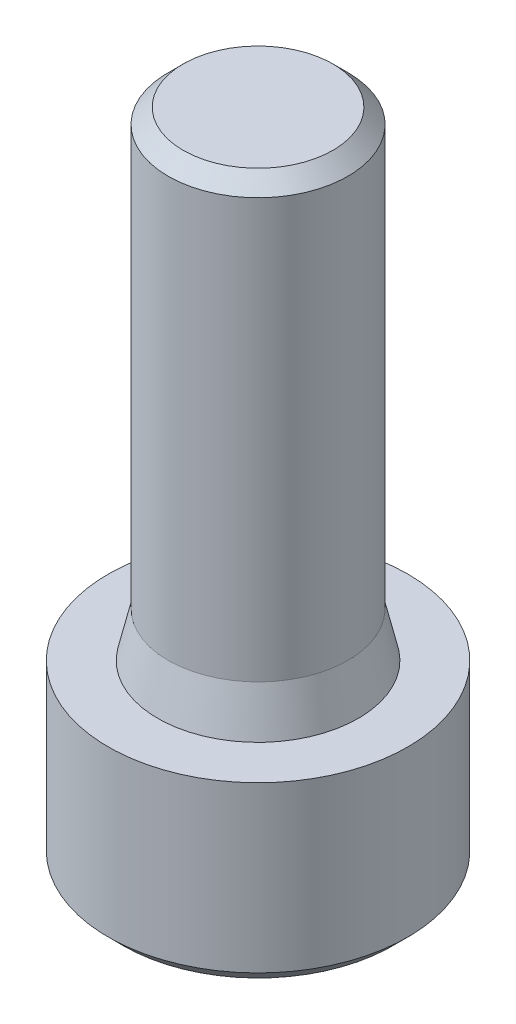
ISO-10303-21;
HEADER;
FILE_DESCRIPTION(('STEP AP214'),'2;1');
FILE_NAME('part.step','',(''),(''),'','','');
FILE_SCHEMA(('AUTOMOTIVE_DESIGN { 1 0 10303 214 1 1 1 1 }'));
ENDSEC;
DATA;
#1=APPLICATION_CONTEXT('core data for automotive mechanical design processes');
#2=APPLICATION_PROTOCOL_DEFINITION('international standard','automotive_design',2000,#1);
#3=PRODUCT_CONTEXT('',#1,'mechanical');
#4=PRODUCT('Part','Part','',(#3));
#5=PRODUCT_RELATED_PRODUCT_CATEGORY('part','',(#4));
#6=PRODUCT_DEFINITION_FORMATION('','',#4);
#7=PRODUCT_DEFINITION_CONTEXT('part definition',#1,'design');
#8=PRODUCT_DEFINITION('design','',#6,#7);
#9=PRODUCT_DEFINITION_SHAPE('','',#8);
#10=(LENGTH_UNIT() NAMED_UNIT(*) SI_UNIT(.MILLI.,.METRE.));
#11=(NAMED_UNIT(*) PLANE_ANGLE_UNIT() SI_UNIT($,.RADIAN.));
#12=(NAMED_UNIT(*) SI_UNIT($,.STERADIAN.) SOLID_ANGLE_UNIT());
#13=UNCERTAINTY_MEASURE_WITH_UNIT(LENGTH_MEASURE(1.E-05),#10,'distance_accuracy_value','');
#14=(GEOMETRIC_REPRESENTATION_CONTEXT(3) GLOBAL_UNCERTAINTY_ASSIGNED_CONTEXT((#13)) GLOBAL_UNIT_ASSIGNED_CONTEXT((#10,
#11,#12)) REPRESENTATION_CONTEXT('',''));
#15=CARTESIAN_POINT('',(0.,0.,0.));
#16=DIRECTION('',(0.,0.,1.));
#17=DIRECTION('',(1.,0.,0.));
#18=AXIS2_PLACEMENT_3D('',#15,#16,#17);
#19=CARTESIAN_POINT('',(0.,22.,0.));
#20=DIRECTION('',(0.,1.,0.));
#21=DIRECTION('',(0.,0.,1.));
#22=AXIS2_PLACEMENT_3D('',#19,#20,#21);
#23=PLANE('',#22);
#24=CARTESIAN_POINT('',(0.,22.,0.));
#25=DIRECTION('',(0.,1.,0.));
#26=DIRECTION('',(0.,0.,1.));
#27=AXIS2_PLACEMENT_3D('',#24,#25,#26);
#28=CIRCLE('',#27,2.49999999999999);
#29=CARTESIAN_POINT('',(0.,22.,2.49999999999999));
#30=VERTEX_POINT('',#29);
#31=EDGE_CURVE('E64',#30,#30,#28,.T.);
#32=ORIENTED_EDGE('',*,*,#31,.T.);
#33=EDGE_LOOP('',(#32));
#34=FACE_BOUND('',#33,.T.);
#35=ADVANCED_FACE('F49',(#34),#23,.T.);
#36=CARTESIAN_POINT('',(0.,0.,0.));
#37=DIRECTION('',(0.,-1.,0.));
#38=DIRECTION('',(0.,0.,-1.));
#39=AXIS2_PLACEMENT_3D('',#36,#37,#38);
#40=CYLINDRICAL_SURFACE('',#39,3.);
#41=CARTESIAN_POINT('',(0.,21.5,0.));
#42=DIRECTION('',(0.,1.,0.));
#43=DIRECTION('',(0.,0.,1.));
#44=AXIS2_PLACEMENT_3D('',#41,#42,#43);
#45=CIRCLE('',#44,3.);
#46=CARTESIAN_POINT('',(0.,21.5,3.));
#47=VERTEX_POINT('',#46);
#48=EDGE_CURVE('E149',#47,#47,#45,.F.);
#49=ORIENTED_EDGE('',*,*,#48,.T.);
#50=EDGE_LOOP('',(#49));
#51=FACE_BOUND('',#50,.T.);
#52=CARTESIAN_POINT('',(0.,7.5,0.));
#53=DIRECTION('',(0.,-1.,0.));
#54=DIRECTION('',(0.,0.,-1.));
#55=AXIS2_PLACEMENT_3D('',#52,#53,#54);
#56=CIRCLE('',#55,3.);
#57=CARTESIAN_POINT('',(0.,7.5,-3.));
#58=VERTEX_POINT('',#57);
#59=EDGE_CURVE('E140',#58,#58,#56,.T.);
#60=ORIENTED_EDGE('',*,*,#59,.F.);
#61=EDGE_LOOP('',(#60));
#62=FACE_BOUND('',#61,.T.);
#63=ADVANCED_FACE('F160',(#51,#62),#40,.T.);
#64=CARTESIAN_POINT('',(0.,6.,0.));
#65=DIRECTION('',(0.,-1.,0.));
#66=DIRECTION('',(0.,0.,-1.));
#67=AXIS2_PLACEMENT_3D('',#64,#65,#66);
#68=CONICAL_SURFACE('',#67,3.35,0.229231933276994);
#69=ORIENTED_EDGE('',*,*,#59,.T.);
#70=EDGE_LOOP('',(#69));
#71=FACE_BOUND('',#70,.T.);
#72=CARTESIAN_POINT('',(0.,6.,0.));
#73=DIRECTION('',(0.,-1.,0.));
#74=DIRECTION('',(0.,0.,-1.));
#75=AXIS2_PLACEMENT_3D('',#72,#73,#74);
#76=CIRCLE('',#75,3.35);
#77=CARTESIAN_POINT('',(0.,6.,-3.35));
#78=VERTEX_POINT('',#77);
#79=EDGE_CURVE('E137',#78,#78,#76,.T.);
#80=ORIENTED_EDGE('',*,*,#79,.F.);
#81=EDGE_LOOP('',(#80));
#82=FACE_BOUND('',#81,.T.);
#83=ADVANCED_FACE('F163',(#71,#82),#68,.T.);
#84=CARTESIAN_POINT('',(0.,6.,-3.35));
#85=DIRECTION('',(0.,1.,0.));
#86=DIRECTION('',(0.,0.,1.));
#87=AXIS2_PLACEMENT_3D('',#84,#85,#86);
#88=PLANE('',#87);
#89=ORIENTED_EDGE('',*,*,#79,.T.);
#90=EDGE_LOOP('',(#89));
#91=FACE_BOUND('',#90,.T.);
#92=CARTESIAN_POINT('',(0.,6.,0.));
#93=DIRECTION('',(0.,-1.,0.));
#94=DIRECTION('',(0.,0.,-1.));
#95=AXIS2_PLACEMENT_3D('',#92,#93,#94);
#96=CIRCLE('',#95,5.);
#97=CARTESIAN_POINT('',(0.,6.,-5.));
#98=VERTEX_POINT('',#97);
#99=EDGE_CURVE('E134',#98,#98,#96,.T.);
#100=ORIENTED_EDGE('',*,*,#99,.F.);
#101=EDGE_LOOP('',(#100));
#102=FACE_BOUND('',#101,.T.);
#103=ADVANCED_FACE('F169',(#91,#102),#88,.T.);
#104=CARTESIAN_POINT('',(0.,0.,0.));
#105=DIRECTION('',(0.,-1.,0.));
#106=DIRECTION('',(0.,0.,-1.));
#107=AXIS2_PLACEMENT_3D('',#104,#105,#106);
#108=CYLINDRICAL_SURFACE('',#107,5.);
#109=CARTESIAN_POINT('',(0.,0.5,0.));
#110=DIRECTION('',(0.,-1.,0.));
#111=DIRECTION('',(0.,0.,-1.));
#112=AXIS2_PLACEMENT_3D('',#109,#110,#111);
#113=CIRCLE('',#112,5.);
#114=CARTESIAN_POINT('',(0.,0.5,-5.));
#115=VERTEX_POINT('',#114);
#116=EDGE_CURVE('E146',#115,#115,#113,.F.);
#117=ORIENTED_EDGE('',*,*,#116,.T.);
#118=EDGE_LOOP('',(#117));
#119=FACE_BOUND('',#118,.T.);
#120=ORIENTED_EDGE('',*,*,#99,.T.);
#121=EDGE_LOOP('',(#120));
#122=FACE_BOUND('',#121,.T.);
#123=ADVANCED_FACE('F175',(#119,#122),#108,.T.);
#124=CARTESIAN_POINT('',(0.,0.,0.));
#125=DIRECTION('',(0.,-1.,0.));
#126=DIRECTION('',(0.,0.,-1.));
#127=AXIS2_PLACEMENT_3D('',#124,#125,#126);
#128=PLANE('',#127);
#129=CARTESIAN_POINT('',(0.,0.,0.));
#130=DIRECTION('',(0.,1.,0.));
#131=DIRECTION('',(0.,0.,1.));
#132=AXIS2_PLACEMENT_3D('',#129,#130,#131);
#133=CIRCLE('',#132,3.);
#134=CARTESIAN_POINT('',(0.,0.,3.));
#135=VERTEX_POINT('',#134);
#136=EDGE_CURVE('E375',#135,#135,#133,.T.);
#137=ORIENTED_EDGE('',*,*,#136,.T.);
#138=EDGE_LOOP('',(#137));
#139=FACE_BOUND('',#138,.T.);
#140=CARTESIAN_POINT('',(0.,0.,0.));
#141=DIRECTION('',(0.,-1.,0.));
#142=DIRECTION('',(0.,0.,-1.));
#143=AXIS2_PLACEMENT_3D('',#140,#141,#142);
#144=CIRCLE('',#143,4.5);
#145=CARTESIAN_POINT('',(0.,0.,-4.5));
#146=VERTEX_POINT('',#145);
#147=EDGE_CURVE('E143',#146,#146,#144,.T.);
#148=ORIENTED_EDGE('',*,*,#147,.T.);
#149=EDGE_LOOP('',(#148));
#150=FACE_BOUND('',#149,.T.);
#151=ADVANCED_FACE('F180',(#139,#150),#128,.T.);
#152=CARTESIAN_POINT('',(0.,0.,0.));
#153=DIRECTION('',(0.,1.,0.));
#154=DIRECTION('',(0.,0.,1.));
#155=AXIS2_PLACEMENT_3D('',#152,#153,#154);
#156=CONICAL_SURFACE('',#155,4.5,0.785398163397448);
#157=ORIENTED_EDGE('',*,*,#116,.F.);
#158=EDGE_LOOP('',(#157));
#159=FACE_BOUND('',#158,.T.);
#160=ORIENTED_EDGE('',*,*,#147,.F.);
#161=EDGE_LOOP('',(#160));
#162=FACE_BOUND('',#161,.T.);
#163=ADVANCED_FACE('F157',(#159,#162),#156,.T.);
#164=CARTESIAN_POINT('',(0.,21.5,0.));
#165=DIRECTION('',(0.,-1.,0.));
#166=DIRECTION('',(0.,0.,-1.));
#167=AXIS2_PLACEMENT_3D('',#164,#165,#166);
#168=CONICAL_SURFACE('',#167,3.,0.785398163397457);
#169=ORIENTED_EDGE('',*,*,#31,.F.);
#170=EDGE_LOOP('',(#169));
#171=FACE_BOUND('',#170,.T.);
#172=ORIENTED_EDGE('',*,*,#48,.F.);
#173=EDGE_LOOP('',(#172));
#174=FACE_BOUND('',#173,.T.);
#175=ADVANCED_FACE('F52',(#171,#174),#168,.T.);
#176=CARTESIAN_POINT('',(0.,0.352653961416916,0.));
#177=DIRECTION('',(0.,-1.,0.));
#178=DIRECTION('',(0.,0.,-1.));
#179=AXIS2_PLACEMENT_3D('',#176,#177,#178);
#180=CONICAL_SURFACE('',#179,1.,1.39626340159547);
#181=ORIENTED_EDGE('',*,*,#136,.F.);
#182=EDGE_LOOP('',(#181));
#183=FACE_BOUND('',#182,.T.);
#184=CARTESIAN_POINT('',(2.88686681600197,0.019948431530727,-0.000199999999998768));
#185=CARTESIAN_POINT('',(2.82680410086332,0.0305446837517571,0.103831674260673));
#186=CARTESIAN_POINT('',(2.7666937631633,0.0401511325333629,0.207945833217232));
#187=CARTESIAN_POINT('',(2.64638100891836,0.0570130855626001,0.416333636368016));
#188=CARTESIAN_POINT('',(2.58617857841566,0.064268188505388,0.520607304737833));
#189=CARTESIAN_POINT('',(2.46584059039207,0.0760390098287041,0.729038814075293));
#190=CARTESIAN_POINT('',(2.4057051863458,0.0805608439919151,0.833196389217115));
#191=CARTESIAN_POINT('',(2.28540102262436,0.0866229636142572,1.04156931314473));
#192=CARTESIAN_POINT('',(2.22523226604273,0.0881634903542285,1.14578465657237));
#193=CARTESIAN_POINT('',(2.10489475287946,0.0881634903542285,1.35421534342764));
#194=CARTESIAN_POINT('',(2.04472599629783,0.0866229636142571,1.45843068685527));
#195=CARTESIAN_POINT('',(1.92442183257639,0.080560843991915,1.66680361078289));
#196=CARTESIAN_POINT('',(1.86428642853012,0.0760390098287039,1.77096118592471));
#197=CARTESIAN_POINT('',(1.74394844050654,0.0642681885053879,1.97939269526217));
#198=CARTESIAN_POINT('',(1.68374601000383,0.0570130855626,2.08366636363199));
#199=CARTESIAN_POINT('',(1.56343325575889,0.0401511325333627,2.29205416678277));
#200=CARTESIAN_POINT('',(1.50332291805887,0.0305446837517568,2.39616832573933));
#201=CARTESIAN_POINT('',(1.44326020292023,0.0199484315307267,2.5002));
#202=B_SPLINE_CURVE_WITH_KNOTS('',3,(#184,#185,#186,#187,#188,#189,#190,#191,#192,#193,#194,
#195,#196,#197,#198,#199,#200,#201),.UNSPECIFIED.,.F.,.F.,(4,2,2,2,2,2,2,2,4),(0.,
0.361783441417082,0.723628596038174,1.08466108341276,1.44566435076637,1.80666761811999,
2.16770010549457,2.52954526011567,2.89132870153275),.UNSPECIFIED.);
#203=CARTESIAN_POINT('',(2.88675134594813,0.0199687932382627,0.));
#204=VERTEX_POINT('',#203);
#205=CARTESIAN_POINT('',(1.44337567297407,0.0199687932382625,2.5));
#206=VERTEX_POINT('',#205);
#207=EDGE_CURVE('E118',#204,#206,#202,.T.);
#208=ORIENTED_EDGE('',*,*,#207,.F.);
#209=CARTESIAN_POINT('',(1.44326020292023,0.0199484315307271,-2.5002));
#210=CARTESIAN_POINT('',(1.50332291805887,0.0305446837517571,-2.39616832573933));
#211=CARTESIAN_POINT('',(1.56343325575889,0.040151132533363,-2.29205416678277));
#212=CARTESIAN_POINT('',(1.68374601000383,0.0570130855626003,-2.08366636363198));
#213=CARTESIAN_POINT('',(1.74394844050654,0.0642681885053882,-1.97939269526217));
#214=CARTESIAN_POINT('',(1.86428642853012,0.0760390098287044,-1.77096118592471));
#215=CARTESIAN_POINT('',(1.92442183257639,0.0805608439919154,-1.66680361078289));
#216=CARTESIAN_POINT('',(2.04472599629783,0.0866229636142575,-1.45843068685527));
#217=CARTESIAN_POINT('',(2.10489475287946,0.0881634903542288,-1.35421534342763));
#218=CARTESIAN_POINT('',(2.22523226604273,0.0881634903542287,-1.14578465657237));
#219=CARTESIAN_POINT('',(2.28540102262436,0.0866229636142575,-1.04156931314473));
#220=CARTESIAN_POINT('',(2.4057051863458,0.0805608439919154,-0.833196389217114));
#221=CARTESIAN_POINT('',(2.46584059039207,0.0760390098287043,-0.729038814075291));
#222=CARTESIAN_POINT('',(2.58617857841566,0.0642681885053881,-0.520607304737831));
#223=CARTESIAN_POINT('',(2.64638100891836,0.0570130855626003,-0.416333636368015));
#224=CARTESIAN_POINT('',(2.7666937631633,0.0401511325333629,-0.207945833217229));
#225=CARTESIAN_POINT('',(2.82680410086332,0.0305446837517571,-0.103831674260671));
#226=CARTESIAN_POINT('',(2.88686681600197,0.0199484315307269,0.000200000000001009));
#227=B_SPLINE_CURVE_WITH_KNOTS('',3,(#209,#210,#211,#212,#213,#214,#215,#216,#217,#218,#219,
#220,#221,#222,#223,#224,#225,#226),.UNSPECIFIED.,.F.,.F.,(4,2,2,2,2,2,2,2,4),(0.,
0.361783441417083,0.723628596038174,1.08466108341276,1.44566435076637,1.80666761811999,
2.16770010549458,2.52954526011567,2.89132870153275),.UNSPECIFIED.);
#228=CARTESIAN_POINT('',(1.44337567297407,0.0199687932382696,-2.5));
#229=VERTEX_POINT('',#228);
#230=EDGE_CURVE('E361',#229,#204,#227,.T.);
#231=ORIENTED_EDGE('',*,*,#230,.F.);
#232=CARTESIAN_POINT('',(-4.35178786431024,-0.355963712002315,-2.5));
#233=CARTESIAN_POINT('',(-4.14193627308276,-0.323921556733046,-2.5));
#234=CARTESIAN_POINT('',(-3.9320061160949,-0.292362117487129,-2.5));
#235=CARTESIAN_POINT('',(-3.51189272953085,-0.230844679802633,-2.5));
#236=CARTESIAN_POINT('',(-3.30170947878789,-0.200886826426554,-2.5));
#237=CARTESIAN_POINT('',(-2.88017970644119,-0.143097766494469,-2.5));
#238=CARTESIAN_POINT('',(-2.66883192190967,-0.115275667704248,-2.5));
#239=CARTESIAN_POINT('',(-2.24570934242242,-0.0629732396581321,-2.5));
#240=CARTESIAN_POINT('',(-2.03393453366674,-0.0384930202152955,-2.5));
#241=CARTESIAN_POINT('',(-1.61240619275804,0.00528012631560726,-2.5));
#242=CARTESIAN_POINT('',(-1.40265893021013,0.0246318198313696,-2.5));
#243=CARTESIAN_POINT('',(-0.982648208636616,0.0565089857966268,-2.5));
#244=CARTESIAN_POINT('',(-0.772384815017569,0.0690352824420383,-2.5));
#245=CARTESIAN_POINT('',(-0.351902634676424,0.0852784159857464,-2.5));
#246=CARTESIAN_POINT('',(-0.141684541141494,0.0890121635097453,-2.5));
#247=CARTESIAN_POINT('',(0.278709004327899,0.0869838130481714,-2.5));
#248=CARTESIAN_POINT('',(0.488884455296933,0.0812215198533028,-2.5));
#249=CARTESIAN_POINT('',(0.851230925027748,0.0640375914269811,-2.5));
#250=CARTESIAN_POINT('',(1.00350351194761,0.0546011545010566,-2.5));
#251=CARTESIAN_POINT('',(1.30777400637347,0.0320886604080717,-2.5));
#252=CARTESIAN_POINT('',(1.45977191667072,0.0190126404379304,-2.5));
#253=CARTESIAN_POINT('',(1.76369841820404,-0.0100223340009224,-2.5));
#254=CARTESIAN_POINT('',(1.91562662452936,-0.0259852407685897,-2.5));
#255=CARTESIAN_POINT('',(2.2192375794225,-0.0601025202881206,-2.5));
#256=CARTESIAN_POINT('',(2.37092032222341,-0.078256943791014,-2.5));
#257=CARTESIAN_POINT('',(2.67545249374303,-0.116396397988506,-2.5));
#258=CARTESIAN_POINT('',(2.82830001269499,-0.136396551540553,-2.5));
#259=CARTESIAN_POINT('',(3.13382217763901,-0.17767511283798,-2.5));
#260=CARTESIAN_POINT('',(3.28649682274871,-0.198953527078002,-2.5));
#261=CARTESIAN_POINT('',(3.59133987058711,-0.24243052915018,-2.5));
#262=CARTESIAN_POINT('',(3.74350860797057,-0.264626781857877,-2.5));
#263=CARTESIAN_POINT('',(4.04772858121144,-0.309778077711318,-2.5));
#264=CARTESIAN_POINT('',(4.19977982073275,-0.332733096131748,-2.5));
#265=CARTESIAN_POINT('',(4.35178786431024,-0.355963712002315,-2.5));
#266=B_SPLINE_CURVE_WITH_KNOTS('',3,(#232,#233,#234,#235,#236,#237,#238,#239,#240,#241,#242,
#243,#244,#245,#246,#247,#248,#249,#250,#251,#252,#253,#254,#255,#256,#257,#258,#259,#260,#261,
#262,#263,#264,#265),.UNSPECIFIED.,.F.,.F.,(4,2,2,2,2,2,2,2,2,2,2,2,2,2,2,2,4),(0.,
0.636857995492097,1.27377357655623,1.91326959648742,2.55278662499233,3.18462332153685,
3.81638370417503,4.44692803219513,5.07748532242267,5.53513200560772,5.99277401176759,
6.45104736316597,6.90933132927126,7.37177581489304,7.83422265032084,8.2955577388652,
8.75687780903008),.UNSPECIFIED.);
#267=CARTESIAN_POINT('',(-1.44337567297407,0.0199687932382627,-2.5));
#268=VERTEX_POINT('',#267);
#269=EDGE_CURVE('E356',#268,#229,#266,.T.);
#270=ORIENTED_EDGE('',*,*,#269,.F.);
#271=CARTESIAN_POINT('',(-2.88686681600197,0.0199484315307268,0.000199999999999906));
#272=CARTESIAN_POINT('',(-2.82680410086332,0.030544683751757,-0.103831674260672));
#273=CARTESIAN_POINT('',(-2.7666937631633,0.0401511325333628,-0.20794583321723));
#274=CARTESIAN_POINT('',(-2.64638100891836,0.0570130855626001,-0.416333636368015));
#275=CARTESIAN_POINT('',(-2.58617857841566,0.0642681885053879,-0.520607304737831));
#276=CARTESIAN_POINT('',(-2.46584059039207,0.076039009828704,-0.729038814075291));
#277=CARTESIAN_POINT('',(-2.4057051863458,0.0805608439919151,-0.833196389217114));
#278=CARTESIAN_POINT('',(-2.28540102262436,0.0866229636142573,-1.04156931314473));
#279=CARTESIAN_POINT('',(-2.22523226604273,0.0881634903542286,-1.14578465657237));
#280=CARTESIAN_POINT('',(-2.10489475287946,0.0881634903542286,-1.35421534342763));
#281=CARTESIAN_POINT('',(-2.04472599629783,0.0866229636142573,-1.45843068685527));
#282=CARTESIAN_POINT('',(-1.92442183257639,0.0805608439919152,-1.66680361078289));
#283=CARTESIAN_POINT('',(-1.86428642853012,0.0760390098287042,-1.77096118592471));
#284=CARTESIAN_POINT('',(-1.74394844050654,0.0642681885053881,-1.97939269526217));
#285=CARTESIAN_POINT('',(-1.68374601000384,0.0570130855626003,-2.08366636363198));
#286=CARTESIAN_POINT('',(-1.5634332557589,0.0401511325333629,-2.29205416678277));
#287=CARTESIAN_POINT('',(-1.50332291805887,0.0305446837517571,-2.39616832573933));
#288=CARTESIAN_POINT('',(-1.44326020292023,0.019948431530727,-2.5002));
#289=B_SPLINE_CURVE_WITH_KNOTS('',3,(#271,#272,#273,#274,#275,#276,#277,#278,#279,#280,#281,
#282,#283,#284,#285,#286,#287,#288),.UNSPECIFIED.,.F.,.F.,(4,2,2,2,2,2,2,2,4),(0.,
0.361783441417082,0.723628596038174,1.08466108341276,1.44566435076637,1.80666761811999,
2.16770010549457,2.52954526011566,2.89132870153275),.UNSPECIFIED.);
#290=CARTESIAN_POINT('',(-2.88675134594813,0.0199687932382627,0.));
#291=VERTEX_POINT('',#290);
#292=EDGE_CURVE('E71',#291,#268,#289,.T.);
#293=ORIENTED_EDGE('',*,*,#292,.F.);
#294=CARTESIAN_POINT('',(-1.44326020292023,0.019948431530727,2.5002));
#295=CARTESIAN_POINT('',(-1.50332291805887,0.030544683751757,2.39616832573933));
#296=CARTESIAN_POINT('',(-1.56343325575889,0.0401511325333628,2.29205416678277));
#297=CARTESIAN_POINT('',(-1.68374601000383,0.0570130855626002,2.08366636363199));
#298=CARTESIAN_POINT('',(-1.74394844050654,0.0642681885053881,1.97939269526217));
#299=CARTESIAN_POINT('',(-1.86428642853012,0.0760390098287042,1.77096118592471));
#300=CARTESIAN_POINT('',(-1.92442183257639,0.0805608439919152,1.66680361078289));
#301=CARTESIAN_POINT('',(-2.04472599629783,0.0866229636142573,1.45843068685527));
#302=CARTESIAN_POINT('',(-2.10489475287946,0.0881634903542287,1.35421534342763));
#303=CARTESIAN_POINT('',(-2.22523226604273,0.0881634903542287,1.14578465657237));
#304=CARTESIAN_POINT('',(-2.28540102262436,0.0866229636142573,1.04156931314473));
#305=CARTESIAN_POINT('',(-2.4057051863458,0.0805608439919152,0.833196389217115));
#306=CARTESIAN_POINT('',(-2.46584059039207,0.0760390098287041,0.729038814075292));
#307=CARTESIAN_POINT('',(-2.58617857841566,0.064268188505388,0.520607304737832));
#308=CARTESIAN_POINT('',(-2.64638100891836,0.0570130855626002,0.416333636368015));
#309=CARTESIAN_POINT('',(-2.7666937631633,0.0401511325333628,0.20794583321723));
#310=CARTESIAN_POINT('',(-2.82680410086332,0.030544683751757,0.103831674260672));
#311=CARTESIAN_POINT('',(-2.88686681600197,0.0199484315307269,-0.000200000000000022));
#312=B_SPLINE_CURVE_WITH_KNOTS('',3,(#294,#295,#296,#297,#298,#299,#300,#301,#302,#303,#304,
#305,#306,#307,#308,#309,#310,#311),.UNSPECIFIED.,.F.,.F.,(4,2,2,2,2,2,2,2,4),(0.,
0.361783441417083,0.723628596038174,1.08466108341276,1.44566435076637,1.80666761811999,
2.16770010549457,2.52954526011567,2.89132870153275),.UNSPECIFIED.);
#313=CARTESIAN_POINT('',(-1.44337567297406,0.0199687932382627,2.5));
#314=VERTEX_POINT('',#313);
#315=EDGE_CURVE('E11',#314,#291,#312,.T.);
#316=ORIENTED_EDGE('',*,*,#315,.F.);
#317=CARTESIAN_POINT('',(4.35178786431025,-0.355963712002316,2.5));
#318=CARTESIAN_POINT('',(4.14193627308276,-0.323921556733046,2.5));
#319=CARTESIAN_POINT('',(3.9320061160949,-0.29236211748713,2.5));
#320=CARTESIAN_POINT('',(3.51189272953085,-0.230844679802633,2.5));
#321=CARTESIAN_POINT('',(3.30170947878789,-0.200886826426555,2.5));
#322=CARTESIAN_POINT('',(2.88017970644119,-0.143097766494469,2.5));
#323=CARTESIAN_POINT('',(2.66883192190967,-0.115275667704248,2.5));
#324=CARTESIAN_POINT('',(2.24570934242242,-0.0629732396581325,2.5));
#325=CARTESIAN_POINT('',(2.03393453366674,-0.0384930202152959,2.5));
#326=CARTESIAN_POINT('',(1.61240619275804,0.00528012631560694,2.5));
#327=CARTESIAN_POINT('',(1.40265893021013,0.0246318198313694,2.5));
#328=CARTESIAN_POINT('',(0.982648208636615,0.0565089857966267,2.5));
#329=CARTESIAN_POINT('',(0.772384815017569,0.0690352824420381,2.5));
#330=CARTESIAN_POINT('',(0.351902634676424,0.0852784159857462,2.5));
#331=CARTESIAN_POINT('',(0.141684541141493,0.0890121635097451,2.5));
#332=CARTESIAN_POINT('',(-0.2787090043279,0.0869838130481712,2.5));
#333=CARTESIAN_POINT('',(-0.488884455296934,0.0812215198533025,2.5));
#334=CARTESIAN_POINT('',(-0.851230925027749,0.0640375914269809,2.5));
#335=CARTESIAN_POINT('',(-1.00350351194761,0.0546011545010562,2.5));
#336=CARTESIAN_POINT('',(-1.30777400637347,0.0320886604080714,2.5));
#337=CARTESIAN_POINT('',(-1.45977191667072,0.0190126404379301,2.5));
#338=CARTESIAN_POINT('',(-1.76369841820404,-0.0100223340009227,2.5));
#339=CARTESIAN_POINT('',(-1.91562662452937,-0.0259852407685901,2.5));
#340=CARTESIAN_POINT('',(-2.2192375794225,-0.060102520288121,2.5));
#341=CARTESIAN_POINT('',(-2.37092032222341,-0.0782569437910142,2.5));
#342=CARTESIAN_POINT('',(-2.67545249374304,-0.116396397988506,2.5));
#343=CARTESIAN_POINT('',(-2.82830001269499,-0.136396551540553,2.5));
#344=CARTESIAN_POINT('',(-3.13382217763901,-0.17767511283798,2.5));
#345=CARTESIAN_POINT('',(-3.28649682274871,-0.198953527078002,2.5));
#346=CARTESIAN_POINT('',(-3.59133987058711,-0.24243052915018,2.5));
#347=CARTESIAN_POINT('',(-3.74350860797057,-0.264626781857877,2.5));
#348=CARTESIAN_POINT('',(-4.04772858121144,-0.309778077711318,2.5));
#349=CARTESIAN_POINT('',(-4.19977982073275,-0.332733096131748,2.5));
#350=CARTESIAN_POINT('',(-4.35178786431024,-0.355963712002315,2.5));
#351=B_SPLINE_CURVE_WITH_KNOTS('',3,(#317,#318,#319,#320,#321,#322,#323,#324,#325,#326,#327,
#328,#329,#330,#331,#332,#333,#334,#335,#336,#337,#338,#339,#340,#341,#342,#343,#344,#345,#346,
#347,#348,#349,#350),.UNSPECIFIED.,.F.,.F.,(4,2,2,2,2,2,2,2,2,2,2,2,2,2,2,2,4),(0.,
0.636857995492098,1.27377357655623,1.91326959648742,2.55278662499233,3.18462332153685,
3.81638370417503,4.44692803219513,5.07748532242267,5.53513200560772,5.99277401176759,
6.45104736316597,6.90933132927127,7.37177581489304,7.83422265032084,8.29555773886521,
8.75687780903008),.UNSPECIFIED.);
#352=EDGE_CURVE('E109',#206,#314,#351,.T.);
#353=ORIENTED_EDGE('',*,*,#352,.F.);
#354=EDGE_LOOP('',(#208,#231,#270,#293,#316,#353));
#355=FACE_BOUND('',#354,.T.);
#356=ADVANCED_FACE('F108',(#183,#355),#180,.F.);
#357=CARTESIAN_POINT('',(0.,4.,0.));
#358=DIRECTION('',(0.,-1.,0.));
#359=DIRECTION('',(0.,0.,-1.));
#360=AXIS2_PLACEMENT_3D('',#357,#358,#359);
#361=PLANE('',#360);
#362=DIRECTION('',(-1.,0.,0.));
#363=VECTOR('',#362,1.);
#364=CARTESIAN_POINT('',(1.44337567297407,4.,2.5));
#365=LINE('',#364,#363);
#366=CARTESIAN_POINT('',(1.44337567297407,4.,2.5));
#367=VERTEX_POINT('',#366);
#368=CARTESIAN_POINT('',(-1.44337567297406,4.,2.5));
#369=VERTEX_POINT('',#368);
#370=EDGE_CURVE('E117',#367,#369,#365,.T.);
#371=ORIENTED_EDGE('',*,*,#370,.T.);
#372=DIRECTION('',(-0.5,0.,-0.866025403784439));
#373=VECTOR('',#372,1.);
#374=CARTESIAN_POINT('',(-1.44337567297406,4.,2.5));
#375=LINE('',#374,#373);
#376=CARTESIAN_POINT('',(-2.88675134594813,4.,0.));
#377=VERTEX_POINT('',#376);
#378=EDGE_CURVE('E122',#369,#377,#375,.T.);
#379=ORIENTED_EDGE('',*,*,#378,.T.);
#380=DIRECTION('',(0.5,0.,-0.866025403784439));
#381=VECTOR('',#380,1.);
#382=CARTESIAN_POINT('',(-2.88675134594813,4.,0.));
#383=LINE('',#382,#381);
#384=CARTESIAN_POINT('',(-1.44337567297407,4.,-2.5));
#385=VERTEX_POINT('',#384);
#386=EDGE_CURVE('E392',#377,#385,#383,.T.);
#387=ORIENTED_EDGE('',*,*,#386,.T.);
#388=DIRECTION('',(1.,0.,0.));
#389=VECTOR('',#388,1.);
#390=CARTESIAN_POINT('',(-1.44337567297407,4.,-2.5));
#391=LINE('',#390,#389);
#392=CARTESIAN_POINT('',(1.44337567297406,4.,-2.5));
#393=VERTEX_POINT('',#392);
#394=EDGE_CURVE('E381',#385,#393,#391,.T.);
#395=ORIENTED_EDGE('',*,*,#394,.T.);
#396=DIRECTION('',(0.5,0.,0.866025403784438));
#397=VECTOR('',#396,1.);
#398=CARTESIAN_POINT('',(1.44337567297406,4.,-2.5));
#399=LINE('',#398,#397);
#400=CARTESIAN_POINT('',(2.88675134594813,4.,0.));
#401=VERTEX_POINT('',#400);
#402=EDGE_CURVE('E130',#393,#401,#399,.T.);
#403=ORIENTED_EDGE('',*,*,#402,.T.);
#404=DIRECTION('',(-0.5,0.,0.866025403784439));
#405=VECTOR('',#404,1.);
#406=CARTESIAN_POINT('',(2.88675134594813,4.,0.));
#407=LINE('',#406,#405);
#408=EDGE_CURVE('E125',#401,#367,#407,.T.);
#409=ORIENTED_EDGE('',*,*,#408,.T.);
#410=EDGE_LOOP('',(#371,#379,#387,#395,#403,#409));
#411=FACE_BOUND('',#410,.T.);
#412=ADVANCED_FACE('F219',(#411),#361,.T.);
#413=CARTESIAN_POINT('',(-1.44337567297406,4.,2.5));
#414=DIRECTION('',(-0.866025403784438,0.,0.5));
#415=DIRECTION('',(0.5,0.,0.866025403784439));
#416=AXIS2_PLACEMENT_3D('',#413,#414,#415);
#417=PLANE('',#416);
#418=DIRECTION('',(0.,-1.,0.));
#419=VECTOR('',#418,1.);
#420=CARTESIAN_POINT('',(-1.44337567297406,4.,2.5));
#421=LINE('',#420,#419);
#422=EDGE_CURVE('E115',#369,#314,#421,.T.);
#423=ORIENTED_EDGE('',*,*,#422,.T.);
#424=ORIENTED_EDGE('',*,*,#315,.T.);
#425=DIRECTION('',(0.,-1.,0.));
#426=VECTOR('',#425,1.);
#427=CARTESIAN_POINT('',(-2.88675134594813,4.,0.));
#428=LINE('',#427,#426);
#429=EDGE_CURVE('E124',#377,#291,#428,.T.);
#430=ORIENTED_EDGE('',*,*,#429,.F.);
#431=ORIENTED_EDGE('',*,*,#378,.F.);
#432=EDGE_LOOP('',(#423,#424,#430,#431));
#433=FACE_BOUND('',#432,.T.);
#434=ADVANCED_FACE('F120',(#433),#417,.F.);
#435=CARTESIAN_POINT('',(-2.88675134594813,4.,0.));
#436=DIRECTION('',(-0.866025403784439,0.,-0.5));
#437=DIRECTION('',(-0.5,0.,0.866025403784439));
#438=AXIS2_PLACEMENT_3D('',#435,#436,#437);
#439=PLANE('',#438);
#440=ORIENTED_EDGE('',*,*,#429,.T.);
#441=ORIENTED_EDGE('',*,*,#292,.T.);
#442=DIRECTION('',(0.,-1.,0.));
#443=VECTOR('',#442,1.);
#444=CARTESIAN_POINT('',(-1.44337567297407,4.,-2.5));
#445=LINE('',#444,#443);
#446=EDGE_CURVE('E127',#385,#268,#445,.T.);
#447=ORIENTED_EDGE('',*,*,#446,.F.);
#448=ORIENTED_EDGE('',*,*,#386,.F.);
#449=EDGE_LOOP('',(#440,#441,#447,#448));
#450=FACE_BOUND('',#449,.T.);
#451=ADVANCED_FACE('F242',(#450),#439,.F.);
#452=CARTESIAN_POINT('',(-1.44337567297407,4.,-2.5));
#453=DIRECTION('',(0.,0.,-1.));
#454=DIRECTION('',(-1.,0.,0.));
#455=AXIS2_PLACEMENT_3D('',#452,#453,#454);
#456=PLANE('',#455);
#457=ORIENTED_EDGE('',*,*,#446,.T.);
#458=ORIENTED_EDGE('',*,*,#269,.T.);
#459=DIRECTION('',(0.,-1.,0.));
#460=VECTOR('',#459,1.);
#461=CARTESIAN_POINT('',(1.44337567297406,4.,-2.5));
#462=LINE('',#461,#460);
#463=EDGE_CURVE('E383',#393,#229,#462,.T.);
#464=ORIENTED_EDGE('',*,*,#463,.F.);
#465=ORIENTED_EDGE('',*,*,#394,.F.);
#466=EDGE_LOOP('',(#457,#458,#464,#465));
#467=FACE_BOUND('',#466,.T.);
#468=ADVANCED_FACE('F249',(#467),#456,.F.);
#469=CARTESIAN_POINT('',(1.44337567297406,4.,-2.5));
#470=DIRECTION('',(0.866025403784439,0.,-0.5));
#471=DIRECTION('',(-0.5,0.,-0.866025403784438));
#472=AXIS2_PLACEMENT_3D('',#469,#470,#471);
#473=PLANE('',#472);
#474=ORIENTED_EDGE('',*,*,#463,.T.);
#475=ORIENTED_EDGE('',*,*,#230,.T.);
#476=DIRECTION('',(0.,-1.,0.));
#477=VECTOR('',#476,1.);
#478=CARTESIAN_POINT('',(2.88675134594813,4.,0.));
#479=LINE('',#478,#477);
#480=EDGE_CURVE('E384',#401,#204,#479,.T.);
#481=ORIENTED_EDGE('',*,*,#480,.F.);
#482=ORIENTED_EDGE('',*,*,#402,.F.);
#483=EDGE_LOOP('',(#474,#475,#481,#482));
#484=FACE_BOUND('',#483,.T.);
#485=ADVANCED_FACE('F258',(#484),#473,.F.);
#486=CARTESIAN_POINT('',(2.88675134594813,4.,0.));
#487=DIRECTION('',(0.866025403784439,0.,0.5));
#488=DIRECTION('',(0.5,0.,-0.866025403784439));
#489=AXIS2_PLACEMENT_3D('',#486,#487,#488);
#490=PLANE('',#489);
#491=ORIENTED_EDGE('',*,*,#480,.T.);
#492=ORIENTED_EDGE('',*,*,#207,.T.);
#493=DIRECTION('',(0.,-1.,0.));
#494=VECTOR('',#493,1.);
#495=CARTESIAN_POINT('',(1.44337567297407,4.,2.5));
#496=LINE('',#495,#494);
#497=EDGE_CURVE('E78',#367,#206,#496,.T.);
#498=ORIENTED_EDGE('',*,*,#497,.F.);
#499=ORIENTED_EDGE('',*,*,#408,.F.);
#500=EDGE_LOOP('',(#491,#492,#498,#499));
#501=FACE_BOUND('',#500,.T.);
#502=ADVANCED_FACE('F267',(#501),#490,.F.);
#503=CARTESIAN_POINT('',(1.44337567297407,4.,2.5));
#504=DIRECTION('',(0.,0.,1.));
#505=DIRECTION('',(1.,0.,0.));
#506=AXIS2_PLACEMENT_3D('',#503,#504,#505);
#507=PLANE('',#506);
#508=ORIENTED_EDGE('',*,*,#497,.T.);
#509=ORIENTED_EDGE('',*,*,#352,.T.);
#510=ORIENTED_EDGE('',*,*,#422,.F.);
#511=ORIENTED_EDGE('',*,*,#370,.F.);
#512=EDGE_LOOP('',(#508,#509,#510,#511));
#513=FACE_BOUND('',#512,.T.);
#514=ADVANCED_FACE('F114',(#513),#507,.F.);
#515=CLOSED_SHELL('',(#35,#63,#83,#103,#123,#151,#163,#175,#356,#412,#434,#451,#468,#485,#502,#514));
#516=MANIFOLD_SOLID_BREP('B2',#515);
#517=ADVANCED_BREP_SHAPE_REPRESENTATION('',(#18,#516),#14);
#518=SHAPE_DEFINITION_REPRESENTATION(#9,#517);
ENDSEC;
END-ISO-10303-21;
